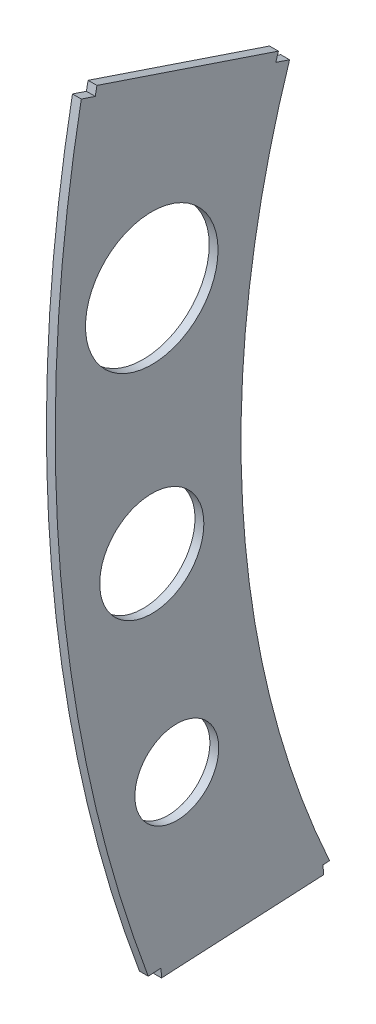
ISO-10303-21;
HEADER;
FILE_DESCRIPTION(('STEP AP214'),'2;1');
FILE_NAME('part.step','',(''),(''),'','','');
FILE_SCHEMA(('AUTOMOTIVE_DESIGN { 1 0 10303 214 1 1 1 1 }'));
ENDSEC;
DATA;
#1=APPLICATION_CONTEXT('core data for automotive mechanical design processes');
#2=APPLICATION_PROTOCOL_DEFINITION('international standard','automotive_design',2000,#1);
#3=PRODUCT_CONTEXT('',#1,'mechanical');
#4=PRODUCT('Part','Part','',(#3));
#5=PRODUCT_RELATED_PRODUCT_CATEGORY('part','',(#4));
#6=PRODUCT_DEFINITION_FORMATION('','',#4);
#7=PRODUCT_DEFINITION_CONTEXT('part definition',#1,'design');
#8=PRODUCT_DEFINITION('design','',#6,#7);
#9=PRODUCT_DEFINITION_SHAPE('','',#8);
#10=(LENGTH_UNIT() NAMED_UNIT(*) SI_UNIT(.MILLI.,.METRE.));
#11=(NAMED_UNIT(*) PLANE_ANGLE_UNIT() SI_UNIT($,.RADIAN.));
#12=(NAMED_UNIT(*) SI_UNIT($,.STERADIAN.) SOLID_ANGLE_UNIT());
#13=UNCERTAINTY_MEASURE_WITH_UNIT(LENGTH_MEASURE(1.E-05),#10,'distance_accuracy_value','');
#14=(GEOMETRIC_REPRESENTATION_CONTEXT(3) GLOBAL_UNCERTAINTY_ASSIGNED_CONTEXT((#13)) GLOBAL_UNIT_ASSIGNED_CONTEXT((#10,
#11,#12)) REPRESENTATION_CONTEXT('',''));
#15=CARTESIAN_POINT('',(0.,0.,0.));
#16=DIRECTION('',(0.,0.,1.));
#17=DIRECTION('',(1.,0.,0.));
#18=AXIS2_PLACEMENT_3D('',#15,#16,#17);
#19=CARTESIAN_POINT('',(12.,-386.92843178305,-1973.74746697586));
#20=DIRECTION('',(-1.,0.,0.));
#21=DIRECTION('',(0.,0.,1.));
#22=AXIS2_PLACEMENT_3D('',#19,#20,#21);
#23=CYLINDRICAL_SURFACE('',#22,2012.30376542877);
#24=DIRECTION('',(-1.,0.,0.));
#25=VECTOR('',#24,1.);
#26=CARTESIAN_POINT('',(25.,-1088.46656554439,-87.6905507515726));
#27=LINE('',#26,#25);
#28=CARTESIAN_POINT('',(12.,-1088.46656554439,-87.6905507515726));
#29=VERTEX_POINT('',#28);
#30=CARTESIAN_POINT('',(0.,-1088.46656554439,-87.6905507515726));
#31=VERTEX_POINT('',#30);
#32=EDGE_CURVE('E244',#29,#31,#27,.T.);
#33=ORIENTED_EDGE('',*,*,#32,.F.);
#34=CARTESIAN_POINT('',(12.,-386.92843178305,-1973.74746697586));
#35=DIRECTION('',(1.,0.,0.));
#36=DIRECTION('',(0.,0.,-1.));
#37=AXIS2_PLACEMENT_3D('',#34,#35,#36);
#38=CIRCLE('',#37,2012.30376542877);
#39=CARTESIAN_POINT('',(12.,-11.4650132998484,3.21830555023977));
#40=VERTEX_POINT('',#39);
#41=EDGE_CURVE('E286',#40,#29,#38,.T.);
#42=ORIENTED_EDGE('',*,*,#41,.F.);
#43=DIRECTION('',(-1.,0.,0.));
#44=VECTOR('',#43,1.);
#45=CARTESIAN_POINT('',(12.,-11.4650132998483,3.21830555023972));
#46=LINE('',#45,#44);
#47=CARTESIAN_POINT('',(0.,-11.4650132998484,3.21830555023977));
#48=VERTEX_POINT('',#47);
#49=EDGE_CURVE('E284',#40,#48,#46,.T.);
#50=ORIENTED_EDGE('',*,*,#49,.T.);
#51=CARTESIAN_POINT('',(0.,-386.92843178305,-1973.74746697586));
#52=DIRECTION('',(1.,0.,0.));
#53=DIRECTION('',(0.,0.,-1.));
#54=AXIS2_PLACEMENT_3D('',#51,#52,#53);
#55=CIRCLE('',#54,2012.30376542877);
#56=EDGE_CURVE('E281',#48,#31,#55,.T.);
#57=ORIENTED_EDGE('',*,*,#56,.T.);
#58=EDGE_LOOP('',(#33,#42,#50,#57));
#59=FACE_BOUND('',#58,.T.);
#60=ADVANCED_FACE('F33',(#59),#23,.T.);
#61=CARTESIAN_POINT('',(12.,-521.559767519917,-1550.84424947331));
#62=DIRECTION('',(-1.,0.,0.));
#63=DIRECTION('',(0.,0.,1.));
#64=AXIS2_PLACEMENT_3D('',#61,#62,#63);
#65=PLANE('',#64);
#66=CARTESIAN_POINT('',(12.,-281.747595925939,-92.5146293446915));
#67=DIRECTION('',(1.,0.,0.));
#68=DIRECTION('',(0.,0.,-1.));
#69=AXIS2_PLACEMENT_3D('',#66,#67,#68);
#70=CIRCLE('',#69,89.9840937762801);
#71=CARTESIAN_POINT('',(12.,-281.747595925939,-182.498723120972));
#72=VERTEX_POINT('',#71);
#73=EDGE_CURVE('E311',#72,#72,#70,.T.);
#74=ORIENTED_EDGE('',*,*,#73,.F.);
#75=EDGE_LOOP('',(#74));
#76=FACE_BOUND('',#75,.T.);
#77=CARTESIAN_POINT('',(12.,-593.878965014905,-92.5146293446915));
#78=DIRECTION('',(1.,0.,0.));
#79=DIRECTION('',(0.,0.,-1.));
#80=AXIS2_PLACEMENT_3D('',#77,#78,#79);
#81=CIRCLE('',#80,70.6940300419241);
#82=CARTESIAN_POINT('',(12.,-593.878965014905,-163.208659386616));
#83=VERTEX_POINT('',#82);
#84=EDGE_CURVE('E307',#83,#83,#81,.T.);
#85=ORIENTED_EDGE('',*,*,#84,.F.);
#86=EDGE_LOOP('',(#85));
#87=FACE_BOUND('',#86,.T.);
#88=CARTESIAN_POINT('',(12.,-867.825114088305,-126.500771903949));
#89=DIRECTION('',(1.,0.,0.));
#90=DIRECTION('',(0.,0.,-1.));
#91=AXIS2_PLACEMENT_3D('',#88,#89,#90);
#92=CIRCLE('',#91,56.9336513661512);
#93=CARTESIAN_POINT('',(12.,-867.825114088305,-183.4344232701));
#94=VERTEX_POINT('',#93);
#95=EDGE_CURVE('E303',#94,#94,#92,.T.);
#96=ORIENTED_EDGE('',*,*,#95,.F.);
#97=EDGE_LOOP('',(#96));
#98=FACE_BOUND('',#97,.T.);
#99=DIRECTION('',(0.,-0.0515409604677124,0.998670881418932));
#100=VECTOR('',#99,1.);
#101=CARTESIAN_POINT('',(12.,-1011.64847930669,-1576.13751013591));
#102=LINE('',#101,#100);
#103=CARTESIAN_POINT('',(12.,-1087.56789574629,-105.103407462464));
#104=VERTEX_POINT('',#103);
#105=EDGE_CURVE('E249',#104,#29,#102,.T.);
#106=ORIENTED_EDGE('',*,*,#105,.F.);
#107=DIRECTION('',(0.,0.998670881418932,0.0515409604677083));
#108=VECTOR('',#107,1.);
#109=CARTESIAN_POINT('',(12.,-597.479183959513,-79.8101467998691));
#110=LINE('',#109,#108);
#111=CARTESIAN_POINT('',(12.,-1099.5678957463,-105.72272213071));
#112=VERTEX_POINT('',#111);
#113=EDGE_CURVE('E246',#112,#104,#110,.T.);
#114=ORIENTED_EDGE('',*,*,#113,.F.);
#115=DIRECTION('',(0.,0.0515409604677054,-0.998670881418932));
#116=VECTOR('',#115,1.);
#117=CARTESIAN_POINT('',(12.,-1023.6484793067,-1576.75682480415));
#118=LINE('',#117,#116);
#119=CARTESIAN_POINT('',(12.,-1088.21379349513,-325.722722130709));
#120=VERTEX_POINT('',#119);
#121=EDGE_CURVE('E269',#112,#120,#118,.T.);
#122=ORIENTED_EDGE('',*,*,#121,.T.);
#123=DIRECTION('',(0.,0.998670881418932,0.0515409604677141));
#124=VECTOR('',#123,1.);
#125=CARTESIAN_POINT('',(12.,-586.125081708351,-299.810146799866));
#126=LINE('',#125,#124);
#127=CARTESIAN_POINT('',(12.,-1076.21379349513,-325.103407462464));
#128=VERTEX_POINT('',#127);
#129=EDGE_CURVE('E260',#120,#128,#126,.T.);
#130=ORIENTED_EDGE('',*,*,#129,.T.);
#131=DIRECTION('',(0.,0.0515409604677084,-0.998670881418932));
#132=VECTOR('',#131,1.);
#133=CARTESIAN_POINT('',(12.,-1011.6484793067,-1576.1375101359));
#134=LINE('',#133,#132);
#135=CARTESIAN_POINT('',(12.,-1075.75972176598,-333.901617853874));
#136=VERTEX_POINT('',#135);
#137=EDGE_CURVE('E264',#128,#136,#134,.T.);
#138=ORIENTED_EDGE('',*,*,#137,.T.);
#139=CARTESIAN_POINT('',(12.,-521.559767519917,-1550.84424947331));
#140=DIRECTION('',(-1.,0.,0.));
#141=DIRECTION('',(0.,0.,1.));
#142=AXIS2_PLACEMENT_3D('',#139,#140,#141);
#143=CIRCLE('',#142,1337.19368751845);
#144=CARTESIAN_POINT('',(12.,-106.69780076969,-279.633603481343));
#145=VERTEX_POINT('',#144);
#146=EDGE_CURVE('E315',#136,#145,#143,.T.);
#147=ORIENTED_EDGE('',*,*,#146,.T.);
#148=DIRECTION('',(0.,-0.318763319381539,-0.947834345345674));
#149=VECTOR('',#148,1.);
#150=CARTESIAN_POINT('',(12.,-100.416845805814,-260.95734911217));
#151=LINE('',#150,#149);
#152=CARTESIAN_POINT('',(12.,-100.416845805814,-260.95734911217));
#153=VERTEX_POINT('',#152);
#154=EDGE_CURVE('E280',#153,#145,#151,.T.);
#155=ORIENTED_EDGE('',*,*,#154,.F.);
#156=DIRECTION('',(0.,-0.956720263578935,0.291009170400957));
#157=VECTOR('',#156,1.);
#158=CARTESIAN_POINT('',(12.,-88.9362026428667,-264.449459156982));
#159=LINE('',#158,#157);
#160=CARTESIAN_POINT('',(12.,-88.9362026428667,-264.449459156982));
#161=VERTEX_POINT('',#160);
#162=EDGE_CURVE('E332',#161,#153,#159,.T.);
#163=ORIENTED_EDGE('',*,*,#162,.F.);
#164=DIRECTION('',(0.,0.318763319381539,0.947834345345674));
#165=VECTOR('',#164,1.);
#166=CARTESIAN_POINT('',(12.,0.317526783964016,0.944157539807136));
#167=LINE('',#166,#165);
#168=CARTESIAN_POINT('',(12.,-6.05773960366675,-18.0125293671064));
#169=VERTEX_POINT('',#168);
#170=EDGE_CURVE('E290',#161,#169,#167,.T.);
#171=ORIENTED_EDGE('',*,*,#170,.T.);
#172=DIRECTION('',(0.,0.981878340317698,-0.189512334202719));
#173=VECTOR('',#172,1.);
#174=CARTESIAN_POINT('',(12.,-6.05773960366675,-18.0125293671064));
#175=LINE('',#174,#173);
#176=CARTESIAN_POINT('',(12.,-17.8402796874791,-15.7383813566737));
#177=VERTEX_POINT('',#176);
#178=EDGE_CURVE('E276',#177,#169,#175,.T.);
#179=ORIENTED_EDGE('',*,*,#178,.F.);
#180=DIRECTION('',(0.,-0.318763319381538,-0.947834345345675));
#181=VECTOR('',#180,1.);
#182=CARTESIAN_POINT('',(12.,-17.8402796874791,-15.7383813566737));
#183=LINE('',#182,#181);
#184=EDGE_CURVE('E291',#40,#177,#183,.T.);
#185=ORIENTED_EDGE('',*,*,#184,.F.);
#186=ORIENTED_EDGE('',*,*,#41,.T.);
#187=EDGE_LOOP('',(#106,#114,#122,#130,#138,#147,#155,#163,#171,#179,#185,#186));
#188=FACE_BOUND('',#187,.T.);
#189=ADVANCED_FACE('F364',(#76,#87,#98,#188),#65,.F.);
#190=CARTESIAN_POINT('',(0.,-521.559767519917,-1550.84424947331));
#191=DIRECTION('',(-1.,0.,0.));
#192=DIRECTION('',(0.,0.,1.));
#193=AXIS2_PLACEMENT_3D('',#190,#191,#192);
#194=PLANE('',#193);
#195=DIRECTION('',(0.,0.742611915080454,-0.669721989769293));
#196=VECTOR('',#195,1.);
#197=CARTESIAN_POINT('',(0.,-980.120094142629,-110.473803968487));
#198=LINE('',#197,#196);
#199=CARTESIAN_POINT('',(0.,-989.031437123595,-102.437140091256));
#200=VERTEX_POINT('',#199);
#201=CARTESIAN_POINT('',(0.,-980.120094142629,-110.473803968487));
#202=VERTEX_POINT('',#201);
#203=EDGE_CURVE('E48',#200,#202,#198,.T.);
#204=ORIENTED_EDGE('',*,*,#203,.F.);
#205=DIRECTION('',(0.,0.669721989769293,0.742611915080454));
#206=VECTOR('',#205,1.);
#207=CARTESIAN_POINT('',(0.,-989.031437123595,-102.437140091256));
#208=LINE('',#207,#206);
#209=CARTESIAN_POINT('',(0.,-1056.00363610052,-176.698331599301));
#210=VERTEX_POINT('',#209);
#211=EDGE_CURVE('E189',#210,#200,#208,.T.);
#212=ORIENTED_EDGE('',*,*,#211,.F.);
#213=DIRECTION('',(0.,-0.742611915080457,0.66972198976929));
#214=VECTOR('',#213,1.);
#215=CARTESIAN_POINT('',(0.,-1047.09229311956,-184.734995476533));
#216=LINE('',#215,#214);
#217=CARTESIAN_POINT('',(0.,-1047.09229311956,-184.734995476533));
#218=VERTEX_POINT('',#217);
#219=EDGE_CURVE('E192',#218,#210,#216,.T.);
#220=ORIENTED_EDGE('',*,*,#219,.F.);
#221=DIRECTION('',(0.,-0.669721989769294,-0.742611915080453));
#222=VECTOR('',#221,1.);
#223=CARTESIAN_POINT('',(0.,-1047.09229311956,-184.734995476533));
#224=LINE('',#223,#222);
#225=EDGE_CURVE('E198',#202,#218,#224,.T.);
#226=ORIENTED_EDGE('',*,*,#225,.F.);
#227=EDGE_LOOP('',(#204,#212,#220,#226));
#228=FACE_BOUND('',#227,.T.);
#229=DIRECTION('',(0.,-1.,0.));
#230=VECTOR('',#229,1.);
#231=CARTESIAN_POINT('',(0.,-441.731689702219,-167.514629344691));
#232=LINE('',#231,#230);
#233=CARTESIAN_POINT('',(0.,-441.731689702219,-167.514629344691));
#234=VERTEX_POINT('',#233);
#235=CARTESIAN_POINT('',(0.,-453.731689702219,-167.514629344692));
#236=VERTEX_POINT('',#235);
#237=EDGE_CURVE('E56',#234,#236,#232,.T.);
#238=ORIENTED_EDGE('',*,*,#237,.F.);
#239=DIRECTION('',(0.,0.,-1.));
#240=VECTOR('',#239,1.);
#241=CARTESIAN_POINT('',(0.,-441.731689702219,-167.514629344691));
#242=LINE('',#241,#240);
#243=CARTESIAN_POINT('',(0.,-441.731689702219,-17.5146293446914));
#244=VERTEX_POINT('',#243);
#245=EDGE_CURVE('E211',#244,#234,#242,.T.);
#246=ORIENTED_EDGE('',*,*,#245,.F.);
#247=DIRECTION('',(0.,1.,0.));
#248=VECTOR('',#247,1.);
#249=CARTESIAN_POINT('',(0.,-441.731689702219,-17.5146293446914));
#250=LINE('',#249,#248);
#251=CARTESIAN_POINT('',(0.,-453.731689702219,-17.5146293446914));
#252=VERTEX_POINT('',#251);
#253=EDGE_CURVE('E225',#252,#244,#250,.T.);
#254=ORIENTED_EDGE('',*,*,#253,.F.);
#255=DIRECTION('',(0.,0.,1.));
#256=VECTOR('',#255,1.);
#257=CARTESIAN_POINT('',(0.,-453.731689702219,-167.514629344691));
#258=LINE('',#257,#256);
#259=EDGE_CURVE('E222',#236,#252,#258,.T.);
#260=ORIENTED_EDGE('',*,*,#259,.F.);
#261=EDGE_LOOP('',(#238,#246,#254,#260));
#262=FACE_BOUND('',#261,.T.);
#263=CARTESIAN_POINT('',(0.,-867.825114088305,-126.500771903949));
#264=DIRECTION('',(-1.,0.,0.));
#265=DIRECTION('',(0.,0.,1.));
#266=AXIS2_PLACEMENT_3D('',#263,#264,#265);
#267=CIRCLE('',#266,56.9336513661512);
#268=CARTESIAN_POINT('',(0.,-867.825114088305,-69.5671205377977));
#269=VERTEX_POINT('',#268);
#270=EDGE_CURVE('E306',#269,#269,#267,.T.);
#271=ORIENTED_EDGE('',*,*,#270,.F.);
#272=EDGE_LOOP('',(#271));
#273=FACE_BOUND('',#272,.T.);
#274=CARTESIAN_POINT('',(0.,-593.878965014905,-92.5146293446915));
#275=DIRECTION('',(-1.,0.,0.));
#276=DIRECTION('',(0.,0.,1.));
#277=AXIS2_PLACEMENT_3D('',#274,#275,#276);
#278=CIRCLE('',#277,70.6940300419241);
#279=CARTESIAN_POINT('',(0.,-593.878965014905,-21.8205993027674));
#280=VERTEX_POINT('',#279);
#281=EDGE_CURVE('E310',#280,#280,#278,.T.);
#282=ORIENTED_EDGE('',*,*,#281,.F.);
#283=EDGE_LOOP('',(#282));
#284=FACE_BOUND('',#283,.T.);
#285=CARTESIAN_POINT('',(0.,-281.747595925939,-92.5146293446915));
#286=DIRECTION('',(-1.,0.,0.));
#287=DIRECTION('',(0.,0.,1.));
#288=AXIS2_PLACEMENT_3D('',#285,#286,#287);
#289=CIRCLE('',#288,89.9840937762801);
#290=CARTESIAN_POINT('',(0.,-281.747595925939,-2.53053556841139));
#291=VERTEX_POINT('',#290);
#292=EDGE_CURVE('E289',#291,#291,#289,.T.);
#293=ORIENTED_EDGE('',*,*,#292,.F.);
#294=EDGE_LOOP('',(#293));
#295=FACE_BOUND('',#294,.T.);
#296=DIRECTION('',(0.,0.998670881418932,0.0515409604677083));
#297=VECTOR('',#296,1.);
#298=CARTESIAN_POINT('',(0.,2.52083841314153,-48.8444122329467));
#299=LINE('',#298,#297);
#300=CARTESIAN_POINT('',(0.,-1099.5678957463,-105.72272213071));
#301=VERTEX_POINT('',#300);
#302=CARTESIAN_POINT('',(0.,-1087.56789574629,-105.103407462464));
#303=VERTEX_POINT('',#302);
#304=EDGE_CURVE('E240',#301,#303,#299,.T.);
#305=ORIENTED_EDGE('',*,*,#304,.T.);
#306=DIRECTION('',(0.,-0.0515409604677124,0.998670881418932));
#307=VECTOR('',#306,1.);
#308=CARTESIAN_POINT('',(0.,-1090.08873415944,-56.258995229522));
#309=LINE('',#308,#307);
#310=EDGE_CURVE('E232',#303,#31,#309,.T.);
#311=ORIENTED_EDGE('',*,*,#310,.T.);
#312=ORIENTED_EDGE('',*,*,#56,.F.);
#313=DIRECTION('',(0.,0.318763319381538,0.947834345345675));
#314=VECTOR('',#313,1.);
#315=CARTESIAN_POINT('',(0.,-532.832182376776,-1547.05325751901));
#316=LINE('',#315,#314);
#317=CARTESIAN_POINT('',(0.,-17.840279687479,-15.7383813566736));
#318=VERTEX_POINT('',#317);
#319=EDGE_CURVE('E295',#318,#48,#316,.T.);
#320=ORIENTED_EDGE('',*,*,#319,.F.);
#321=DIRECTION('',(0.,-0.981878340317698,0.189512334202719));
#322=VECTOR('',#321,1.);
#323=CARTESIAN_POINT('',(0.,-217.819204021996,22.8595499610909));
#324=LINE('',#323,#322);
#325=CARTESIAN_POINT('',(0.,-6.05773960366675,-18.0125293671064));
#326=VERTEX_POINT('',#325);
#327=EDGE_CURVE('E294',#326,#318,#324,.T.);
#328=ORIENTED_EDGE('',*,*,#327,.F.);
#329=DIRECTION('',(0.,0.318763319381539,0.947834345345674));
#330=VECTOR('',#329,1.);
#331=CARTESIAN_POINT('',(0.,0.317526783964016,0.944157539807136));
#332=LINE('',#331,#330);
#333=CARTESIAN_POINT('',(0.,-88.9362026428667,-264.449459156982));
#334=VERTEX_POINT('',#333);
#335=EDGE_CURVE('E301',#334,#326,#332,.T.);
#336=ORIENTED_EDGE('',*,*,#335,.F.);
#337=DIRECTION('',(0.,0.956720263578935,-0.291009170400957));
#338=VECTOR('',#337,1.);
#339=CARTESIAN_POINT('',(0.,-126.771667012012,-252.940904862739));
#340=LINE('',#339,#338);
#341=CARTESIAN_POINT('',(0.,-100.416845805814,-260.95734911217));
#342=VERTEX_POINT('',#341);
#343=EDGE_CURVE('E277',#342,#334,#340,.T.);
#344=ORIENTED_EDGE('',*,*,#343,.F.);
#345=DIRECTION('',(0.,0.318763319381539,0.947834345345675));
#346=VECTOR('',#345,1.);
#347=CARTESIAN_POINT('',(0.,-532.928949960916,-1547.02071390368));
#348=LINE('',#347,#346);
#349=CARTESIAN_POINT('',(0.,-106.69780076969,-279.633603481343));
#350=VERTEX_POINT('',#349);
#351=EDGE_CURVE('E272',#350,#342,#348,.T.);
#352=ORIENTED_EDGE('',*,*,#351,.F.);
#353=CARTESIAN_POINT('',(0.,-521.559767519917,-1550.84424947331));
#354=DIRECTION('',(-1.,0.,0.));
#355=DIRECTION('',(0.,0.,1.));
#356=AXIS2_PLACEMENT_3D('',#353,#354,#355);
#357=CIRCLE('',#356,1337.19368751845);
#358=CARTESIAN_POINT('',(0.,-1075.75972176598,-333.901617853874));
#359=VERTEX_POINT('',#358);
#360=EDGE_CURVE('E271',#359,#350,#357,.T.);
#361=ORIENTED_EDGE('',*,*,#360,.F.);
#362=DIRECTION('',(0.,0.0515409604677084,-0.998670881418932));
#363=VECTOR('',#362,1.);
#364=CARTESIAN_POINT('',(0.,-1090.08873415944,-56.2589952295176));
#365=LINE('',#364,#363);
#366=CARTESIAN_POINT('',(0.,-1076.21379349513,-325.103407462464));
#367=VERTEX_POINT('',#366);
#368=EDGE_CURVE('E254',#367,#359,#365,.T.);
#369=ORIENTED_EDGE('',*,*,#368,.F.);
#370=DIRECTION('',(0.,0.998670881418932,0.0515409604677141));
#371=VECTOR('',#370,1.);
#372=CARTESIAN_POINT('',(0.,13.874940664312,-268.84441223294));
#373=LINE('',#372,#371);
#374=CARTESIAN_POINT('',(0.,-1088.21379349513,-325.72272213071));
#375=VERTEX_POINT('',#374);
#376=EDGE_CURVE('E251',#375,#367,#373,.T.);
#377=ORIENTED_EDGE('',*,*,#376,.F.);
#378=DIRECTION('',(0.,0.0515409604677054,-0.998670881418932));
#379=VECTOR('',#378,1.);
#380=CARTESIAN_POINT('',(0.,-1087.51191864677,-339.322429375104));
#381=LINE('',#380,#379);
#382=EDGE_CURVE('E267',#301,#375,#381,.T.);
#383=ORIENTED_EDGE('',*,*,#382,.F.);
#384=EDGE_LOOP('',(#305,#311,#312,#320,#328,#336,#344,#352,#361,#369,#377,#383));
#385=FACE_BOUND('',#384,.T.);
#386=ADVANCED_FACE('F353',(#228,#262,#273,#284,#295,#385),#194,.T.);
#387=CARTESIAN_POINT('',(25.,-1087.51191864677,-339.322429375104));
#388=DIRECTION('',(0.,0.998670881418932,0.0515409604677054));
#389=DIRECTION('',(0.,-0.0515409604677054,0.998670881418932));
#390=AXIS2_PLACEMENT_3D('',#387,#388,#389);
#391=PLANE('',#390);
#392=DIRECTION('',(1.,0.,0.));
#393=VECTOR('',#392,1.);
#394=CARTESIAN_POINT('',(25.,-1099.5678957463,-105.72272213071));
#395=LINE('',#394,#393);
#396=EDGE_CURVE('E11',#301,#112,#395,.T.);
#397=ORIENTED_EDGE('',*,*,#396,.F.);
#398=ORIENTED_EDGE('',*,*,#382,.T.);
#399=DIRECTION('',(1.,0.,0.));
#400=VECTOR('',#399,1.);
#401=CARTESIAN_POINT('',(25.,-1088.21379349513,-325.72272213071));
#402=LINE('',#401,#400);
#403=EDGE_CURVE('E41',#375,#120,#402,.T.);
#404=ORIENTED_EDGE('',*,*,#403,.T.);
#405=ORIENTED_EDGE('',*,*,#121,.F.);
#406=EDGE_LOOP('',(#397,#398,#404,#405));
#407=FACE_BOUND('',#406,.T.);
#408=ADVANCED_FACE('F344',(#407),#391,.F.);
#409=CARTESIAN_POINT('',(12.,-521.559767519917,-1550.84424947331));
#410=DIRECTION('',(-1.,0.,0.));
#411=DIRECTION('',(0.,0.,1.));
#412=AXIS2_PLACEMENT_3D('',#409,#410,#411);
#413=CYLINDRICAL_SURFACE('',#412,1337.19368751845);
#414=ORIENTED_EDGE('',*,*,#146,.F.);
#415=DIRECTION('',(-1.,0.,0.));
#416=VECTOR('',#415,1.);
#417=CARTESIAN_POINT('',(25.,-1075.75972176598,-333.901617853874));
#418=LINE('',#417,#416);
#419=EDGE_CURVE('E257',#136,#359,#418,.T.);
#420=ORIENTED_EDGE('',*,*,#419,.T.);
#421=ORIENTED_EDGE('',*,*,#360,.T.);
#422=DIRECTION('',(-1.,0.,0.));
#423=VECTOR('',#422,1.);
#424=CARTESIAN_POINT('',(12.,-106.69780076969,-279.633603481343));
#425=LINE('',#424,#423);
#426=EDGE_CURVE('E317',#350,#145,#425,.F.);
#427=ORIENTED_EDGE('',*,*,#426,.T.);
#428=EDGE_LOOP('',(#414,#420,#421,#427));
#429=FACE_BOUND('',#428,.T.);
#430=ADVANCED_FACE('F35',(#429),#413,.F.);
#431=CARTESIAN_POINT('',(12.,0.317526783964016,0.944157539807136));
#432=DIRECTION('',(0.,-0.947834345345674,0.318763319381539));
#433=DIRECTION('',(0.,-0.318763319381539,-0.947834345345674));
#434=AXIS2_PLACEMENT_3D('',#431,#432,#433);
#435=PLANE('',#434);
#436=ORIENTED_EDGE('',*,*,#170,.F.);
#437=DIRECTION('',(1.,0.,0.));
#438=VECTOR('',#437,1.);
#439=CARTESIAN_POINT('',(-2.,-88.9362026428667,-264.449459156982));
#440=LINE('',#439,#438);
#441=EDGE_CURVE('E279',#334,#161,#440,.T.);
#442=ORIENTED_EDGE('',*,*,#441,.F.);
#443=ORIENTED_EDGE('',*,*,#335,.T.);
#444=DIRECTION('',(1.,0.,0.));
#445=VECTOR('',#444,1.);
#446=CARTESIAN_POINT('',(-2.,-6.05773960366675,-18.0125293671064));
#447=LINE('',#446,#445);
#448=EDGE_CURVE('E285',#326,#169,#447,.T.);
#449=ORIENTED_EDGE('',*,*,#448,.T.);
#450=EDGE_LOOP('',(#436,#442,#443,#449));
#451=FACE_BOUND('',#450,.T.);
#452=ADVANCED_FACE('F375',(#451),#435,.F.);
#453=CARTESIAN_POINT('',(-2.,-281.747595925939,-92.5146293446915));
#454=DIRECTION('',(1.,0.,0.));
#455=DIRECTION('',(0.,0.,-1.));
#456=AXIS2_PLACEMENT_3D('',#453,#454,#455);
#457=CYLINDRICAL_SURFACE('',#456,89.9840937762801);
#458=ORIENTED_EDGE('',*,*,#292,.T.);
#459=EDGE_LOOP('',(#458));
#460=FACE_BOUND('',#459,.T.);
#461=ORIENTED_EDGE('',*,*,#73,.T.);
#462=EDGE_LOOP('',(#461));
#463=FACE_BOUND('',#462,.T.);
#464=ADVANCED_FACE('F426',(#460,#463),#457,.F.);
#465=CARTESIAN_POINT('',(-2.,-593.878965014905,-92.5146293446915));
#466=DIRECTION('',(1.,0.,0.));
#467=DIRECTION('',(0.,0.,-1.));
#468=AXIS2_PLACEMENT_3D('',#465,#466,#467);
#469=CYLINDRICAL_SURFACE('',#468,70.6940300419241);
#470=ORIENTED_EDGE('',*,*,#281,.T.);
#471=EDGE_LOOP('',(#470));
#472=FACE_BOUND('',#471,.T.);
#473=ORIENTED_EDGE('',*,*,#84,.T.);
#474=EDGE_LOOP('',(#473));
#475=FACE_BOUND('',#474,.T.);
#476=ADVANCED_FACE('F422',(#472,#475),#469,.F.);
#477=CARTESIAN_POINT('',(-2.,-867.825114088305,-126.500771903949));
#478=DIRECTION('',(1.,0.,0.));
#479=DIRECTION('',(0.,0.,-1.));
#480=AXIS2_PLACEMENT_3D('',#477,#478,#479);
#481=CYLINDRICAL_SURFACE('',#480,56.9336513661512);
#482=ORIENTED_EDGE('',*,*,#270,.T.);
#483=EDGE_LOOP('',(#482));
#484=FACE_BOUND('',#483,.T.);
#485=ORIENTED_EDGE('',*,*,#95,.T.);
#486=EDGE_LOOP('',(#485));
#487=FACE_BOUND('',#486,.T.);
#488=ADVANCED_FACE('F419',(#484,#487),#481,.F.);
#489=CARTESIAN_POINT('',(-2.,-17.8402796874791,-15.7383813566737));
#490=DIRECTION('',(0.,-0.947834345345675,0.318763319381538));
#491=DIRECTION('',(0.,-0.318763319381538,-0.947834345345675));
#492=AXIS2_PLACEMENT_3D('',#489,#490,#491);
#493=PLANE('',#492);
#494=ORIENTED_EDGE('',*,*,#319,.T.);
#495=ORIENTED_EDGE('',*,*,#49,.F.);
#496=ORIENTED_EDGE('',*,*,#184,.T.);
#497=DIRECTION('',(1.,0.,0.));
#498=VECTOR('',#497,1.);
#499=CARTESIAN_POINT('',(-2.,-17.8402796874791,-15.7383813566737));
#500=LINE('',#499,#498);
#501=EDGE_CURVE('E298',#318,#177,#500,.T.);
#502=ORIENTED_EDGE('',*,*,#501,.F.);
#503=EDGE_LOOP('',(#494,#495,#496,#502));
#504=FACE_BOUND('',#503,.T.);
#505=ADVANCED_FACE('F384',(#504),#493,.F.);
#506=CARTESIAN_POINT('',(-2.,-6.05773960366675,-18.0125293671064));
#507=DIRECTION('',(0.,-0.189512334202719,-0.981878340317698));
#508=DIRECTION('',(0.,0.981878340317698,-0.189512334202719));
#509=AXIS2_PLACEMENT_3D('',#506,#507,#508);
#510=PLANE('',#509);
#511=ORIENTED_EDGE('',*,*,#327,.T.);
#512=ORIENTED_EDGE('',*,*,#501,.T.);
#513=ORIENTED_EDGE('',*,*,#178,.T.);
#514=ORIENTED_EDGE('',*,*,#448,.F.);
#515=EDGE_LOOP('',(#511,#512,#513,#514));
#516=FACE_BOUND('',#515,.T.);
#517=ADVANCED_FACE('F380',(#516),#510,.F.);
#518=CARTESIAN_POINT('',(-2.,-100.416845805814,-260.95734911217));
#519=DIRECTION('',(0.,-0.947834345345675,0.318763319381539));
#520=DIRECTION('',(0.,-0.318763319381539,-0.947834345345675));
#521=AXIS2_PLACEMENT_3D('',#518,#519,#520);
#522=PLANE('',#521);
#523=ORIENTED_EDGE('',*,*,#351,.T.);
#524=DIRECTION('',(1.,0.,0.));
#525=VECTOR('',#524,1.);
#526=CARTESIAN_POINT('',(-2.,-100.416845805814,-260.95734911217));
#527=LINE('',#526,#525);
#528=EDGE_CURVE('E275',#342,#153,#527,.T.);
#529=ORIENTED_EDGE('',*,*,#528,.T.);
#530=ORIENTED_EDGE('',*,*,#154,.T.);
#531=ORIENTED_EDGE('',*,*,#426,.F.);
#532=EDGE_LOOP('',(#523,#529,#530,#531));
#533=FACE_BOUND('',#532,.T.);
#534=ADVANCED_FACE('F367',(#533),#522,.F.);
#535=CARTESIAN_POINT('',(-2.,-88.9362026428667,-264.449459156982));
#536=DIRECTION('',(0.,0.291009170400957,0.956720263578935));
#537=DIRECTION('',(0.,-0.956720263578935,0.291009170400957));
#538=AXIS2_PLACEMENT_3D('',#535,#536,#537);
#539=PLANE('',#538);
#540=ORIENTED_EDGE('',*,*,#343,.T.);
#541=ORIENTED_EDGE('',*,*,#441,.T.);
#542=ORIENTED_EDGE('',*,*,#162,.T.);
#543=ORIENTED_EDGE('',*,*,#528,.F.);
#544=EDGE_LOOP('',(#540,#541,#542,#543));
#545=FACE_BOUND('',#544,.T.);
#546=ADVANCED_FACE('F370',(#545),#539,.F.);
#547=CARTESIAN_POINT('',(25.,-1090.08873415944,-56.2589952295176));
#548=DIRECTION('',(0.,0.998670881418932,0.0515409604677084));
#549=DIRECTION('',(0.,-0.0515409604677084,0.998670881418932));
#550=AXIS2_PLACEMENT_3D('',#547,#548,#549);
#551=PLANE('',#550);
#552=DIRECTION('',(-1.,0.,0.));
#553=VECTOR('',#552,1.);
#554=CARTESIAN_POINT('',(25.,-1076.21379349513,-325.103407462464));
#555=LINE('',#554,#553);
#556=EDGE_CURVE('E256',#128,#367,#555,.T.);
#557=ORIENTED_EDGE('',*,*,#556,.T.);
#558=ORIENTED_EDGE('',*,*,#368,.T.);
#559=ORIENTED_EDGE('',*,*,#419,.F.);
#560=ORIENTED_EDGE('',*,*,#137,.F.);
#561=EDGE_LOOP('',(#557,#558,#559,#560));
#562=FACE_BOUND('',#561,.T.);
#563=ADVANCED_FACE('F357',(#562),#551,.F.);
#564=CARTESIAN_POINT('',(25.,13.874940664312,-268.84441223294));
#565=DIRECTION('',(0.,-0.0515409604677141,0.998670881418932));
#566=DIRECTION('',(0.,-0.998670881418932,-0.0515409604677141));
#567=AXIS2_PLACEMENT_3D('',#564,#565,#566);
#568=PLANE('',#567);
#569=ORIENTED_EDGE('',*,*,#403,.F.);
#570=ORIENTED_EDGE('',*,*,#376,.T.);
#571=ORIENTED_EDGE('',*,*,#556,.F.);
#572=ORIENTED_EDGE('',*,*,#129,.F.);
#573=EDGE_LOOP('',(#569,#570,#571,#572));
#574=FACE_BOUND('',#573,.T.);
#575=ADVANCED_FACE('F349',(#574),#568,.F.);
#576=CARTESIAN_POINT('',(25.,-1090.08873415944,-56.258995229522));
#577=DIRECTION('',(0.,-0.998670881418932,-0.0515409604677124));
#578=DIRECTION('',(0.,0.0515409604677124,-0.998670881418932));
#579=AXIS2_PLACEMENT_3D('',#576,#577,#578);
#580=PLANE('',#579);
#581=ORIENTED_EDGE('',*,*,#105,.T.);
#582=ORIENTED_EDGE('',*,*,#32,.T.);
#583=ORIENTED_EDGE('',*,*,#310,.F.);
#584=DIRECTION('',(-1.,0.,0.));
#585=VECTOR('',#584,1.);
#586=CARTESIAN_POINT('',(25.,-1087.56789574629,-105.103407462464));
#587=LINE('',#586,#585);
#588=EDGE_CURVE('E243',#104,#303,#587,.T.);
#589=ORIENTED_EDGE('',*,*,#588,.F.);
#590=EDGE_LOOP('',(#581,#582,#583,#589));
#591=FACE_BOUND('',#590,.T.);
#592=ADVANCED_FACE('F392',(#591),#580,.T.);
#593=CARTESIAN_POINT('',(25.,2.52083841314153,-48.8444122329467));
#594=DIRECTION('',(0.,-0.0515409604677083,0.998670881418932));
#595=DIRECTION('',(0.,-0.998670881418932,-0.0515409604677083));
#596=AXIS2_PLACEMENT_3D('',#593,#594,#595);
#597=PLANE('',#596);
#598=ORIENTED_EDGE('',*,*,#113,.T.);
#599=ORIENTED_EDGE('',*,*,#588,.T.);
#600=ORIENTED_EDGE('',*,*,#304,.F.);
#601=ORIENTED_EDGE('',*,*,#396,.T.);
#602=EDGE_LOOP('',(#598,#599,#600,#601));
#603=FACE_BOUND('',#602,.T.);
#604=ADVANCED_FACE('F395',(#603),#597,.T.);
#605=CARTESIAN_POINT('',(7.,-441.731689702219,-167.514629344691));
#606=DIRECTION('',(0.,0.,-1.));
#607=DIRECTION('',(-1.,0.,0.));
#608=AXIS2_PLACEMENT_3D('',#605,#606,#607);
#609=PLANE('',#608);
#610=ORIENTED_EDGE('',*,*,#237,.T.);
#611=DIRECTION('',(-1.,0.,0.));
#612=VECTOR('',#611,1.);
#613=CARTESIAN_POINT('',(7.,-453.731689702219,-167.514629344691));
#614=LINE('',#613,#612);
#615=CARTESIAN_POINT('',(7.,-453.731689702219,-167.514629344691));
#616=VERTEX_POINT('',#615);
#617=EDGE_CURVE('E220',#616,#236,#614,.T.);
#618=ORIENTED_EDGE('',*,*,#617,.F.);
#619=DIRECTION('',(0.,-1.,0.));
#620=VECTOR('',#619,1.);
#621=CARTESIAN_POINT('',(7.,-441.731689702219,-167.514629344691));
#622=LINE('',#621,#620);
#623=CARTESIAN_POINT('',(7.,-441.731689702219,-167.514629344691));
#624=VERTEX_POINT('',#623);
#625=EDGE_CURVE('E207',#624,#616,#622,.T.);
#626=ORIENTED_EDGE('',*,*,#625,.F.);
#627=DIRECTION('',(-1.,0.,0.));
#628=VECTOR('',#627,1.);
#629=CARTESIAN_POINT('',(7.,-441.731689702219,-167.514629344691));
#630=LINE('',#629,#628);
#631=EDGE_CURVE('E230',#624,#234,#630,.T.);
#632=ORIENTED_EDGE('',*,*,#631,.T.);
#633=EDGE_LOOP('',(#610,#618,#626,#632));
#634=FACE_BOUND('',#633,.T.);
#635=ADVANCED_FACE('F397',(#634),#609,.F.);
#636=CARTESIAN_POINT('',(7.,-441.731689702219,-167.514629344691));
#637=DIRECTION('',(0.,1.,0.));
#638=DIRECTION('',(0.,0.,1.));
#639=AXIS2_PLACEMENT_3D('',#636,#637,#638);
#640=PLANE('',#639);
#641=ORIENTED_EDGE('',*,*,#245,.T.);
#642=ORIENTED_EDGE('',*,*,#631,.F.);
#643=DIRECTION('',(0.,0.,-1.));
#644=VECTOR('',#643,1.);
#645=CARTESIAN_POINT('',(7.,-441.731689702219,-167.514629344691));
#646=LINE('',#645,#644);
#647=CARTESIAN_POINT('',(7.,-441.731689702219,-17.5146293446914));
#648=VERTEX_POINT('',#647);
#649=EDGE_CURVE('E217',#648,#624,#646,.T.);
#650=ORIENTED_EDGE('',*,*,#649,.F.);
#651=DIRECTION('',(-1.,0.,0.));
#652=VECTOR('',#651,1.);
#653=CARTESIAN_POINT('',(7.,-441.731689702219,-17.5146293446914));
#654=LINE('',#653,#652);
#655=EDGE_CURVE('E233',#648,#244,#654,.T.);
#656=ORIENTED_EDGE('',*,*,#655,.T.);
#657=EDGE_LOOP('',(#641,#642,#650,#656));
#658=FACE_BOUND('',#657,.T.);
#659=ADVANCED_FACE('F403',(#658),#640,.F.);
#660=CARTESIAN_POINT('',(7.,-441.731689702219,-17.5146293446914));
#661=DIRECTION('',(0.,0.,1.));
#662=DIRECTION('',(1.,0.,0.));
#663=AXIS2_PLACEMENT_3D('',#660,#661,#662);
#664=PLANE('',#663);
#665=ORIENTED_EDGE('',*,*,#253,.T.);
#666=ORIENTED_EDGE('',*,*,#655,.F.);
#667=DIRECTION('',(0.,1.,0.));
#668=VECTOR('',#667,1.);
#669=CARTESIAN_POINT('',(7.,-441.731689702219,-17.5146293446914));
#670=LINE('',#669,#668);
#671=CARTESIAN_POINT('',(7.,-453.731689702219,-17.5146293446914));
#672=VERTEX_POINT('',#671);
#673=EDGE_CURVE('E214',#672,#648,#670,.T.);
#674=ORIENTED_EDGE('',*,*,#673,.F.);
#675=DIRECTION('',(-1.,0.,0.));
#676=VECTOR('',#675,1.);
#677=CARTESIAN_POINT('',(7.,-453.731689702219,-17.5146293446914));
#678=LINE('',#677,#676);
#679=EDGE_CURVE('E235',#672,#252,#678,.T.);
#680=ORIENTED_EDGE('',*,*,#679,.T.);
#681=EDGE_LOOP('',(#665,#666,#674,#680));
#682=FACE_BOUND('',#681,.T.);
#683=ADVANCED_FACE('F471',(#682),#664,.F.);
#684=CARTESIAN_POINT('',(7.,-453.731689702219,-167.514629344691));
#685=DIRECTION('',(0.,-1.,0.));
#686=DIRECTION('',(0.,0.,-1.));
#687=AXIS2_PLACEMENT_3D('',#684,#685,#686);
#688=PLANE('',#687);
#689=ORIENTED_EDGE('',*,*,#259,.T.);
#690=ORIENTED_EDGE('',*,*,#679,.F.);
#691=DIRECTION('',(0.,0.,1.));
#692=VECTOR('',#691,1.);
#693=CARTESIAN_POINT('',(7.,-453.731689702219,-167.514629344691));
#694=LINE('',#693,#692);
#695=EDGE_CURVE('E210',#616,#672,#694,.T.);
#696=ORIENTED_EDGE('',*,*,#695,.F.);
#697=ORIENTED_EDGE('',*,*,#617,.T.);
#698=EDGE_LOOP('',(#689,#690,#696,#697));
#699=FACE_BOUND('',#698,.T.);
#700=ADVANCED_FACE('F462',(#699),#688,.F.);
#701=CARTESIAN_POINT('',(7.,0.,0.));
#702=DIRECTION('',(-1.,0.,0.));
#703=DIRECTION('',(0.,0.,1.));
#704=AXIS2_PLACEMENT_3D('',#701,#702,#703);
#705=PLANE('',#704);
#706=ORIENTED_EDGE('',*,*,#625,.T.);
#707=ORIENTED_EDGE('',*,*,#695,.T.);
#708=ORIENTED_EDGE('',*,*,#673,.T.);
#709=ORIENTED_EDGE('',*,*,#649,.T.);
#710=EDGE_LOOP('',(#706,#707,#708,#709));
#711=FACE_BOUND('',#710,.T.);
#712=ADVANCED_FACE('F468',(#711),#705,.T.);
#713=CARTESIAN_POINT('',(7.,-980.120094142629,-110.473803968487));
#714=DIRECTION('',(0.,0.669721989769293,0.742611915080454));
#715=DIRECTION('',(0.,-0.742611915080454,0.669721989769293));
#716=AXIS2_PLACEMENT_3D('',#713,#714,#715);
#717=PLANE('',#716);
#718=ORIENTED_EDGE('',*,*,#203,.T.);
#719=DIRECTION('',(-1.,0.,0.));
#720=VECTOR('',#719,1.);
#721=CARTESIAN_POINT('',(7.,-980.120094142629,-110.473803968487));
#722=LINE('',#721,#720);
#723=CARTESIAN_POINT('',(7.,-980.120094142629,-110.473803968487));
#724=VERTEX_POINT('',#723);
#725=EDGE_CURVE('E167',#724,#202,#722,.T.);
#726=ORIENTED_EDGE('',*,*,#725,.F.);
#727=DIRECTION('',(0.,0.742611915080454,-0.669721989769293));
#728=VECTOR('',#727,1.);
#729=CARTESIAN_POINT('',(7.,-980.120094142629,-110.473803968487));
#730=LINE('',#729,#728);
#731=CARTESIAN_POINT('',(7.,-989.031437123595,-102.437140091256));
#732=VERTEX_POINT('',#731);
#733=EDGE_CURVE('E171',#732,#724,#730,.T.);
#734=ORIENTED_EDGE('',*,*,#733,.F.);
#735=DIRECTION('',(-1.,0.,0.));
#736=VECTOR('',#735,1.);
#737=CARTESIAN_POINT('',(7.,-989.031437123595,-102.437140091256));
#738=LINE('',#737,#736);
#739=EDGE_CURVE('E202',#732,#200,#738,.T.);
#740=ORIENTED_EDGE('',*,*,#739,.T.);
#741=EDGE_LOOP('',(#718,#726,#734,#740));
#742=FACE_BOUND('',#741,.T.);
#743=ADVANCED_FACE('F169',(#742),#717,.F.);
#744=CARTESIAN_POINT('',(7.,-989.031437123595,-102.437140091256));
#745=DIRECTION('',(0.,-0.742611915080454,0.669721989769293));
#746=DIRECTION('',(0.,-0.669721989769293,-0.742611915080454));
#747=AXIS2_PLACEMENT_3D('',#744,#745,#746);
#748=PLANE('',#747);
#749=ORIENTED_EDGE('',*,*,#211,.T.);
#750=ORIENTED_EDGE('',*,*,#739,.F.);
#751=DIRECTION('',(0.,0.669721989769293,0.742611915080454));
#752=VECTOR('',#751,1.);
#753=CARTESIAN_POINT('',(7.,-989.031437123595,-102.437140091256));
#754=LINE('',#753,#752);
#755=CARTESIAN_POINT('',(7.,-1056.00363610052,-176.698331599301));
#756=VERTEX_POINT('',#755);
#757=EDGE_CURVE('E177',#756,#732,#754,.T.);
#758=ORIENTED_EDGE('',*,*,#757,.F.);
#759=DIRECTION('',(-1.,0.,0.));
#760=VECTOR('',#759,1.);
#761=CARTESIAN_POINT('',(7.,-1056.00363610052,-176.698331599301));
#762=LINE('',#761,#760);
#763=EDGE_CURVE('E204',#756,#210,#762,.T.);
#764=ORIENTED_EDGE('',*,*,#763,.T.);
#765=EDGE_LOOP('',(#749,#750,#758,#764));
#766=FACE_BOUND('',#765,.T.);
#767=ADVANCED_FACE('F485',(#766),#748,.F.);
#768=CARTESIAN_POINT('',(7.,-1047.09229311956,-184.734995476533));
#769=DIRECTION('',(0.,-0.66972198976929,-0.742611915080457));
#770=DIRECTION('',(0.,0.742611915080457,-0.66972198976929));
#771=AXIS2_PLACEMENT_3D('',#768,#769,#770);
#772=PLANE('',#771);
#773=ORIENTED_EDGE('',*,*,#219,.T.);
#774=ORIENTED_EDGE('',*,*,#763,.F.);
#775=DIRECTION('',(0.,-0.742611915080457,0.66972198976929));
#776=VECTOR('',#775,1.);
#777=CARTESIAN_POINT('',(7.,-1047.09229311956,-184.734995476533));
#778=LINE('',#777,#776);
#779=CARTESIAN_POINT('',(7.,-1047.09229311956,-184.734995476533));
#780=VERTEX_POINT('',#779);
#781=EDGE_CURVE('E185',#780,#756,#778,.T.);
#782=ORIENTED_EDGE('',*,*,#781,.F.);
#783=DIRECTION('',(-1.,0.,0.));
#784=VECTOR('',#783,1.);
#785=CARTESIAN_POINT('',(7.,-1047.09229311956,-184.734995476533));
#786=LINE('',#785,#784);
#787=EDGE_CURVE('E176',#780,#218,#786,.T.);
#788=ORIENTED_EDGE('',*,*,#787,.T.);
#789=EDGE_LOOP('',(#773,#774,#782,#788));
#790=FACE_BOUND('',#789,.T.);
#791=ADVANCED_FACE('F488',(#790),#772,.F.);
#792=CARTESIAN_POINT('',(7.,-1047.09229311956,-184.734995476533));
#793=DIRECTION('',(0.,0.742611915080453,-0.669721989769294));
#794=DIRECTION('',(0.,0.669721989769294,0.742611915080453));
#795=AXIS2_PLACEMENT_3D('',#792,#793,#794);
#796=PLANE('',#795);
#797=ORIENTED_EDGE('',*,*,#225,.T.);
#798=ORIENTED_EDGE('',*,*,#787,.F.);
#799=DIRECTION('',(0.,-0.669721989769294,-0.742611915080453));
#800=VECTOR('',#799,1.);
#801=CARTESIAN_POINT('',(7.,-1047.09229311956,-184.734995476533));
#802=LINE('',#801,#800);
#803=EDGE_CURVE('E180',#724,#780,#802,.T.);
#804=ORIENTED_EDGE('',*,*,#803,.F.);
#805=ORIENTED_EDGE('',*,*,#725,.T.);
#806=EDGE_LOOP('',(#797,#798,#804,#805));
#807=FACE_BOUND('',#806,.T.);
#808=ADVANCED_FACE('F181',(#807),#796,.F.);
#809=CARTESIAN_POINT('',(7.,0.,0.));
#810=DIRECTION('',(1.,0.,0.));
#811=DIRECTION('',(0.,0.,-1.));
#812=AXIS2_PLACEMENT_3D('',#809,#810,#811);
#813=PLANE('',#812);
#814=ORIENTED_EDGE('',*,*,#733,.T.);
#815=ORIENTED_EDGE('',*,*,#803,.T.);
#816=ORIENTED_EDGE('',*,*,#781,.T.);
#817=ORIENTED_EDGE('',*,*,#757,.T.);
#818=EDGE_LOOP('',(#814,#815,#816,#817));
#819=FACE_BOUND('',#818,.T.);
#820=ADVANCED_FACE('F187',(#819),#813,.F.);
#821=CLOSED_SHELL('',(#60,#189,#386,#408,#430,#452,#464,#476,#488,#505,#517,#534,#546,#563,#575,
#592,#604,#635,#659,#683,#700,#712,#743,#767,#791,#808,#820));
#822=MANIFOLD_SOLID_BREP('B2',#821);
#823=ADVANCED_BREP_SHAPE_REPRESENTATION('',(#18,#822),#14);
#824=SHAPE_DEFINITION_REPRESENTATION(#9,#823);
ENDSEC;
END-ISO-10303-21;
